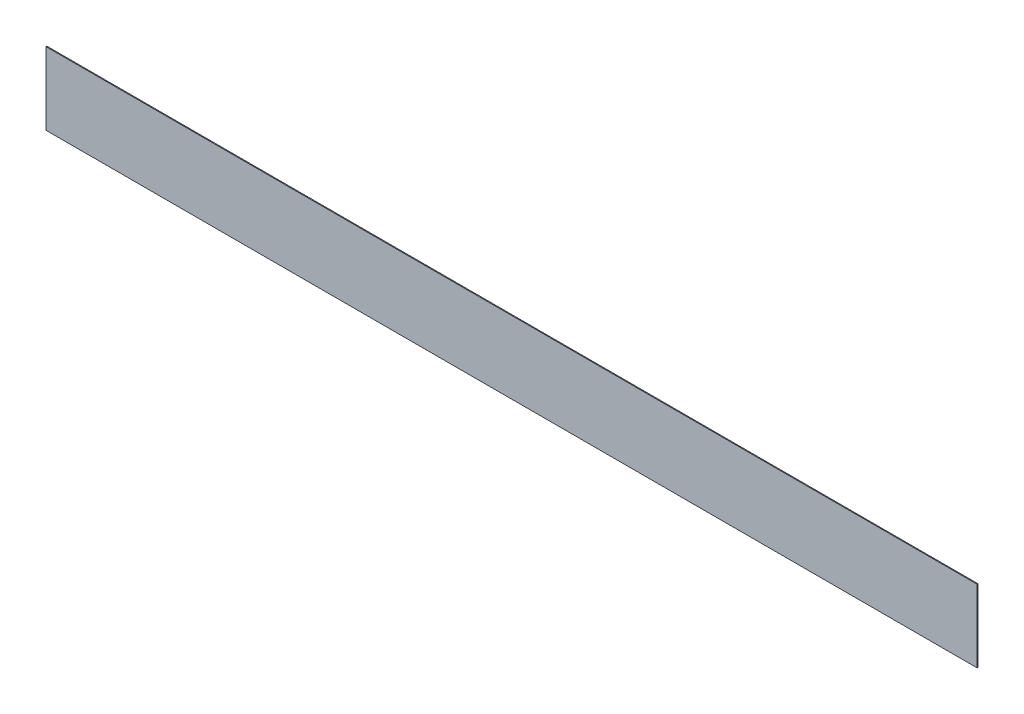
from build123d import *

# Parameters (mm, degrees)
ESQUISSE1_W        = 2120
ESQUISSE1_H        = 165
BOSS_EXTRU_1_DEPTH = 2


with BuildPart() as part:
    # Esquisse1 → Boss.-Extru.1 (new body)
    with BuildSketch(Plane.XY):
        with Locations((941.868931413, -43.647563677)):
            Rectangle(ESQUISSE1_W, ESQUISSE1_H)
    extrude(amount=BOSS_EXTRU_1_DEPTH)


solid = part.part
